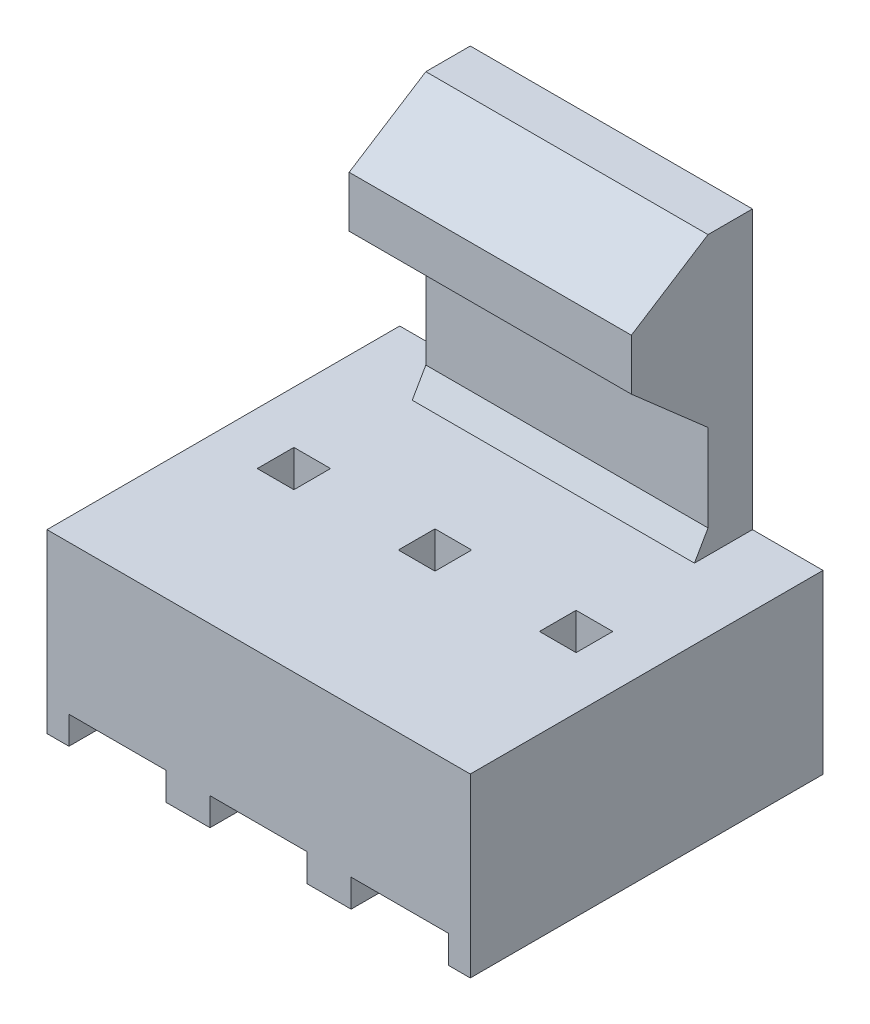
from build123d import *

# Parameters (mm, degrees)
SKETCH1_W          = 7.62
SKETCH1_H          = 6.35
EXTRUDE1_DEPTH     = 3.18
CUT_EXTRUDE1_REACH = 10.059
SKETCH2_W          = 1.75
SKETCH2_H          = 0.5
CUT_EXTRUDE2_REACH = 10.059
SKETCH3_W          = 0.66
SKETCH3_H          = 0.66
EXTRUDE2_DEPTH     = 2.54


with BuildPart() as part:
    # Sketch1 → Extrude1 (new body)
    with BuildSketch(Plane(origin=(0, 0, 0), x_dir=(1, 0, 0), z_dir=(0, 1, 0))):
        with Locations((0, 3.175)):
            Rectangle(SKETCH1_W, SKETCH1_H)
    extrude(amount=-EXTRUDE1_DEPTH)

    # Sketch2 → Cut-Extrude1 (cut, up to next)
    with BuildSketch(Plane.XY, mode=Mode.PRIVATE) as cut_extrude1_sk1:
        with Locations((-2.54, -2.93)):
            Rectangle(SKETCH2_W, SKETCH2_H)
    cut_extrude1_tool1 = extrude(cut_extrude1_sk1.sketch, amount=-CUT_EXTRUDE1_REACH, mode=Mode.PRIVATE) & part.part
    # Sketch2 → Cut-Extrude1 (cut, up to next)
    with BuildSketch(Plane.XY, mode=Mode.PRIVATE) as cut_extrude1_sk2:
        with Locations((0, -2.93)):
            Rectangle(SKETCH2_W, SKETCH2_H)
    cut_extrude1_tool2 = extrude(cut_extrude1_sk2.sketch, amount=-CUT_EXTRUDE1_REACH, mode=Mode.PRIVATE) & part.part
    # Sketch2 → Cut-Extrude1 (cut, up to next)
    with BuildSketch(Plane.XY, mode=Mode.PRIVATE) as cut_extrude1_sk3:
        with Locations((2.54, -2.93)):
            Rectangle(SKETCH2_W, SKETCH2_H)
    cut_extrude1_tool3 = extrude(cut_extrude1_sk3.sketch, amount=-CUT_EXTRUDE1_REACH, mode=Mode.PRIVATE) & part.part
    add(cut_extrude1_tool1.solids().sort_by_distance((-2.54, -2.93, 0))[0], mode=Mode.SUBTRACT)
    add(cut_extrude1_tool2.solids().sort_by_distance((0, -2.93, 0))[0], mode=Mode.SUBTRACT)
    add(cut_extrude1_tool3.solids().sort_by_distance((2.54, -2.93, 0))[0], mode=Mode.SUBTRACT)

    # Sketch3 → Cut-Extrude2 (cut, up to next)
    with BuildSketch(Plane(origin=(0, 0, 0), x_dir=(-1, 0, 0), z_dir=(0, 1, 0)), mode=Mode.PRIVATE) as cut_extrude2_sk1:
        with Locations((2.54, -3.175)):
            Rectangle(SKETCH3_W, SKETCH3_H)
    cut_extrude2_tool1 = extrude(cut_extrude2_sk1.sketch, amount=-CUT_EXTRUDE2_REACH, mode=Mode.PRIVATE) & part.part
    # Sketch3 → Cut-Extrude2 (cut, up to next)
    with BuildSketch(Plane(origin=(0, 0, 0), x_dir=(-1, 0, 0), z_dir=(0, 1, 0)), mode=Mode.PRIVATE) as cut_extrude2_sk2:
        with Locations((0, -3.175)):
            Rectangle(SKETCH3_W, SKETCH3_H)
    cut_extrude2_tool2 = extrude(cut_extrude2_sk2.sketch, amount=-CUT_EXTRUDE2_REACH, mode=Mode.PRIVATE) & part.part
    # Sketch3 → Cut-Extrude2 (cut, up to next)
    with BuildSketch(Plane(origin=(0, 0, 0), x_dir=(-1, 0, 0), z_dir=(0, 1, 0)), mode=Mode.PRIVATE) as cut_extrude2_sk3:
        with Locations((-2.54, -3.175)):
            Rectangle(SKETCH3_W, SKETCH3_H)
    cut_extrude2_tool3 = extrude(cut_extrude2_sk3.sketch, amount=-CUT_EXTRUDE2_REACH, mode=Mode.PRIVATE) & part.part
    add(cut_extrude2_tool1.solids().sort_by_distance((-2.54, 0, -3.175))[0], mode=Mode.SUBTRACT)
    add(cut_extrude2_tool2.solids().sort_by_distance((0, 0, -3.175))[0], mode=Mode.SUBTRACT)
    add(cut_extrude2_tool3.solids().sort_by_distance((2.54, 0, -3.175))[0], mode=Mode.SUBTRACT)

    # Sketch5 → Extrude2 (add, symmetric)
    with BuildSketch(Plane(origin=(0, 0, 0), x_dir=(0, 0, -1), z_dir=(1, 0, 0))):
        Polygon((6.35, 0), (6.35, 5), (5.55, 5), (4.17, 4.121433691), (4.17, 3.201916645), (5.55, 1.99292201), (5.55, 0.426337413), (5.305385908, 0), align=None)
    extrude(amount=EXTRUDE2_DEPTH, both=True)


solid = part.part
